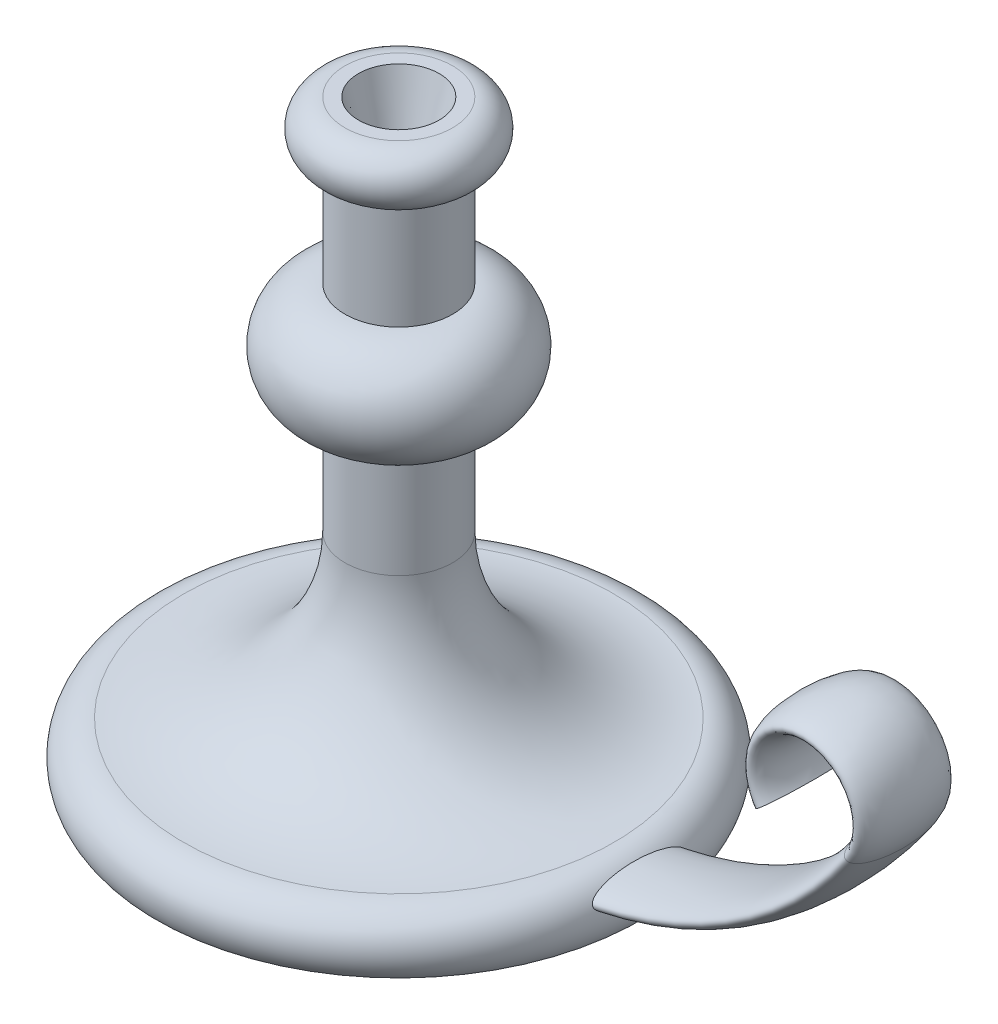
from build123d import *

# Parameters (mm, degrees)
SKETCH3_RX         = 17.5
SKETCH3_RY         = 5
SKETCH4_R          = 15
CUT_EXTRUDE1_DEPTH = 25
CUT_EXTRUDE1_DRAFT = -15


with BuildPart() as part:
    # Sketch1 → Revolve1 (revolve)
    with BuildSketch(Plane.XY, mode=Mode.PRIVATE) as revolve1_sk:
        with BuildLine():
            Line((20, 220), (0, 220))
            Line((0, 220), (0, 0))
            Line((0, 0), (90, 0))
            ThreePointArc((90, 0), (91.180339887, 13.090169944), (80, 20))
            ThreePointArc((80, 20), (37.573593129, 37.573593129), (20, 80))
            Line((20, 80), (20, 120))
            ThreePointArc((20, 120), (40, 140), (20, 160))
            Line((20, 160), (20, 200))
            ThreePointArc((20, 200), (30, 210), (20, 220))
        make_face()
    revolve(revolve1_sk.sketch.rotate(Axis((0, 220, 0), (0, -1, 0)), 180), axis=Axis((0, 220, 0), (0, -1, 0)))

    # Sweep1: sweep along a path in Sketch2
    with BuildLine(Plane.XY) as sweep1_path:
        Line((0, 10), (60, 10))
        ThreePointArc((60, 10), (129.821200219, 27.240819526), (183.592070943, 75))
        ThreePointArc((183.592070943, 75), (167.113128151, 106.333333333), (150.634185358, 75))
    # Sketch3 → Sweep1 (sweep)
    with BuildSketch(Plane(origin=(0, 0, 0), x_dir=(0, 0, -1), z_dir=(1, 0, 0))):
        with Locations((0, 10)):
            Ellipse(SKETCH3_RX, SKETCH3_RY)
    sweep(path=sweep1_path.line)


with BuildPart() as cut_extrude1_tool:
    # Sketch4 → Cut-Extrude1 (with draft: the straight prism first)
    with BuildSketch(Plane(origin=(0, 220, 0), x_dir=(1, 0, 0), z_dir=(0, 1, 0))):
        Circle(SKETCH4_R)
    extrude(amount=-CUT_EXTRUDE1_DEPTH)
    # Cut-Extrude1: the draft: its side faces are tilted about the plane it starts from
    cut_extrude1_sides = [cut_extrude1_tool.faces().sort_by_distance(p)[0] for p in [
        (-15, 207.5, 0),
    ]]
    draft(cut_extrude1_sides, Plane(origin=(0, 220, 0), x_dir=(1, 0, 0), z_dir=(0, 1, 0)), CUT_EXTRUDE1_DRAFT)


with BuildPart() as part_1:
    add(part.part)

    # Cut-Extrude1: cut by cut_extrude1_tool
    add(cut_extrude1_tool.part, mode=Mode.SUBTRACT)


solid = part_1.part
